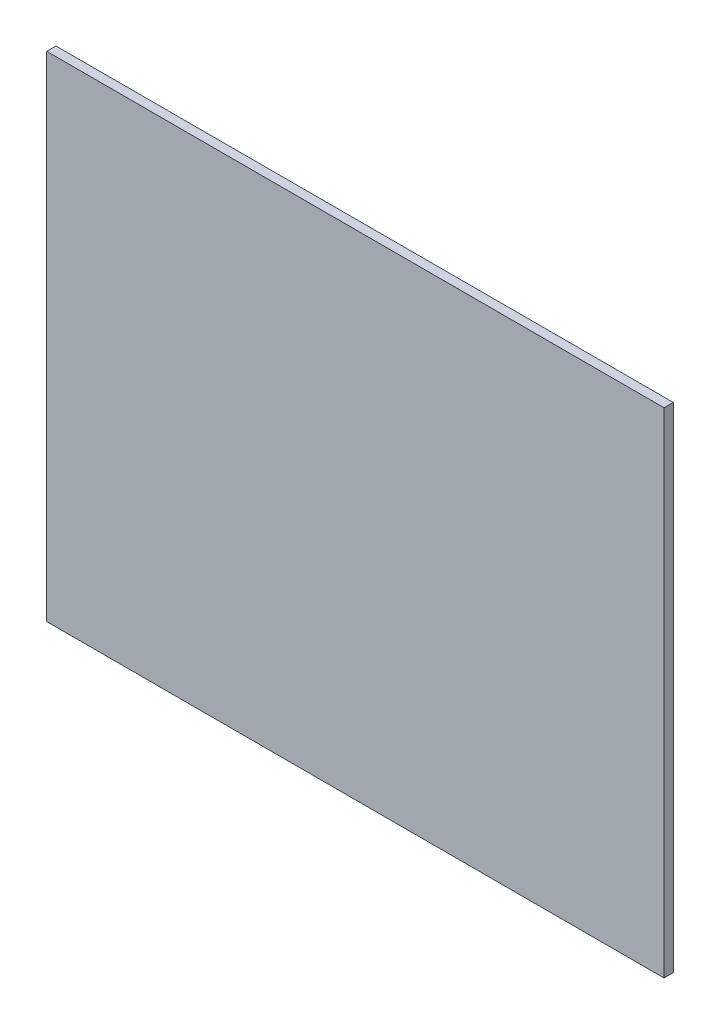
ISO-10303-21;
HEADER;
FILE_DESCRIPTION(('STEP AP214'),'2;1');
FILE_NAME('part.step','',(''),(''),'','','');
FILE_SCHEMA(('AUTOMOTIVE_DESIGN { 1 0 10303 214 1 1 1 1 }'));
ENDSEC;
DATA;
#1=APPLICATION_CONTEXT('core data for automotive mechanical design processes');
#2=APPLICATION_PROTOCOL_DEFINITION('international standard','automotive_design',2000,#1);
#3=PRODUCT_CONTEXT('',#1,'mechanical');
#4=PRODUCT('Part','Part','',(#3));
#5=PRODUCT_RELATED_PRODUCT_CATEGORY('part','',(#4));
#6=PRODUCT_DEFINITION_FORMATION('','',#4);
#7=PRODUCT_DEFINITION_CONTEXT('part definition',#1,'design');
#8=PRODUCT_DEFINITION('design','',#6,#7);
#9=PRODUCT_DEFINITION_SHAPE('','',#8);
#10=(LENGTH_UNIT() NAMED_UNIT(*) SI_UNIT(.MILLI.,.METRE.));
#11=(NAMED_UNIT(*) PLANE_ANGLE_UNIT() SI_UNIT($,.RADIAN.));
#12=(NAMED_UNIT(*) SI_UNIT($,.STERADIAN.) SOLID_ANGLE_UNIT());
#13=UNCERTAINTY_MEASURE_WITH_UNIT(LENGTH_MEASURE(1.E-05),#10,'distance_accuracy_value','');
#14=(GEOMETRIC_REPRESENTATION_CONTEXT(3) GLOBAL_UNCERTAINTY_ASSIGNED_CONTEXT((#13)) GLOBAL_UNIT_ASSIGNED_CONTEXT((#10,
#11,#12)) REPRESENTATION_CONTEXT('',''));
#15=CARTESIAN_POINT('',(0.,0.,0.));
#16=DIRECTION('',(0.,0.,1.));
#17=DIRECTION('',(1.,0.,0.));
#18=AXIS2_PLACEMENT_3D('',#15,#16,#17);
#19=CARTESIAN_POINT('',(100.,80.,3.));
#20=DIRECTION('',(-1.,0.,0.));
#21=DIRECTION('',(0.,-1.,0.));
#22=AXIS2_PLACEMENT_3D('',#19,#20,#21);
#23=PLANE('',#22);
#24=DIRECTION('',(0.,1.,0.));
#25=VECTOR('',#24,1.);
#26=CARTESIAN_POINT('',(100.,80.,0.));
#27=LINE('',#26,#25);
#28=CARTESIAN_POINT('',(100.,-80.,0.));
#29=VERTEX_POINT('',#28);
#30=CARTESIAN_POINT('',(100.,80.,0.));
#31=VERTEX_POINT('',#30);
#32=EDGE_CURVE('E107',#29,#31,#27,.T.);
#33=ORIENTED_EDGE('',*,*,#32,.T.);
#34=DIRECTION('',(0.,0.,-1.));
#35=VECTOR('',#34,1.);
#36=CARTESIAN_POINT('',(100.,80.,3.));
#37=LINE('',#36,#35);
#38=CARTESIAN_POINT('',(100.,80.,3.));
#39=VERTEX_POINT('',#38);
#40=EDGE_CURVE('E11',#39,#31,#37,.T.);
#41=ORIENTED_EDGE('',*,*,#40,.F.);
#42=DIRECTION('',(0.,1.,0.));
#43=VECTOR('',#42,1.);
#44=CARTESIAN_POINT('',(100.,80.,3.));
#45=LINE('',#44,#43);
#46=CARTESIAN_POINT('',(100.,-80.,3.));
#47=VERTEX_POINT('',#46);
#48=EDGE_CURVE('E91',#47,#39,#45,.T.);
#49=ORIENTED_EDGE('',*,*,#48,.F.);
#50=DIRECTION('',(0.,0.,-1.));
#51=VECTOR('',#50,1.);
#52=CARTESIAN_POINT('',(100.,-80.,3.));
#53=LINE('',#52,#51);
#54=EDGE_CURVE('E103',#47,#29,#53,.T.);
#55=ORIENTED_EDGE('',*,*,#54,.T.);
#56=EDGE_LOOP('',(#33,#41,#49,#55));
#57=FACE_BOUND('',#56,.T.);
#58=ADVANCED_FACE('F39',(#57),#23,.F.);
#59=CARTESIAN_POINT('',(-100.,80.,3.));
#60=DIRECTION('',(0.,-1.,0.));
#61=DIRECTION('',(0.,0.,-1.));
#62=AXIS2_PLACEMENT_3D('',#59,#60,#61);
#63=PLANE('',#62);
#64=DIRECTION('',(-1.,0.,0.));
#65=VECTOR('',#64,1.);
#66=CARTESIAN_POINT('',(-100.,80.,0.));
#67=LINE('',#66,#65);
#68=CARTESIAN_POINT('',(-100.,80.,0.));
#69=VERTEX_POINT('',#68);
#70=EDGE_CURVE('E96',#31,#69,#67,.T.);
#71=ORIENTED_EDGE('',*,*,#70,.T.);
#72=DIRECTION('',(0.,0.,-1.));
#73=VECTOR('',#72,1.);
#74=CARTESIAN_POINT('',(-100.,80.,3.));
#75=LINE('',#74,#73);
#76=CARTESIAN_POINT('',(-100.,80.,3.));
#77=VERTEX_POINT('',#76);
#78=EDGE_CURVE('E48',#77,#69,#75,.T.);
#79=ORIENTED_EDGE('',*,*,#78,.F.);
#80=DIRECTION('',(-1.,0.,0.));
#81=VECTOR('',#80,1.);
#82=CARTESIAN_POINT('',(-100.,80.,3.));
#83=LINE('',#82,#81);
#84=EDGE_CURVE('E86',#39,#77,#83,.T.);
#85=ORIENTED_EDGE('',*,*,#84,.F.);
#86=ORIENTED_EDGE('',*,*,#40,.T.);
#87=EDGE_LOOP('',(#71,#79,#85,#86));
#88=FACE_BOUND('',#87,.T.);
#89=ADVANCED_FACE('F95',(#88),#63,.F.);
#90=CARTESIAN_POINT('',(-100.,80.,3.));
#91=DIRECTION('',(1.,0.,0.));
#92=DIRECTION('',(0.,1.,0.));
#93=AXIS2_PLACEMENT_3D('',#90,#91,#92);
#94=PLANE('',#93);
#95=DIRECTION('',(0.,-1.,0.));
#96=VECTOR('',#95,1.);
#97=CARTESIAN_POINT('',(-100.,80.,0.));
#98=LINE('',#97,#96);
#99=CARTESIAN_POINT('',(-100.,-80.,0.));
#100=VERTEX_POINT('',#99);
#101=EDGE_CURVE('E73',#69,#100,#98,.T.);
#102=ORIENTED_EDGE('',*,*,#101,.T.);
#103=DIRECTION('',(0.,0.,-1.));
#104=VECTOR('',#103,1.);
#105=CARTESIAN_POINT('',(-100.,-80.,3.));
#106=LINE('',#105,#104);
#107=CARTESIAN_POINT('',(-100.,-80.,3.));
#108=VERTEX_POINT('',#107);
#109=EDGE_CURVE('E98',#108,#100,#106,.T.);
#110=ORIENTED_EDGE('',*,*,#109,.F.);
#111=DIRECTION('',(0.,-1.,0.));
#112=VECTOR('',#111,1.);
#113=CARTESIAN_POINT('',(-100.,80.,3.));
#114=LINE('',#113,#112);
#115=EDGE_CURVE('E89',#77,#108,#114,.T.);
#116=ORIENTED_EDGE('',*,*,#115,.F.);
#117=ORIENTED_EDGE('',*,*,#78,.T.);
#118=EDGE_LOOP('',(#102,#110,#116,#117));
#119=FACE_BOUND('',#118,.T.);
#120=ADVANCED_FACE('F99',(#119),#94,.F.);
#121=CARTESIAN_POINT('',(-100.,-80.,3.));
#122=DIRECTION('',(0.,1.,0.));
#123=DIRECTION('',(0.,0.,1.));
#124=AXIS2_PLACEMENT_3D('',#121,#122,#123);
#125=PLANE('',#124);
#126=DIRECTION('',(1.,0.,0.));
#127=VECTOR('',#126,1.);
#128=CARTESIAN_POINT('',(-100.,-80.,0.));
#129=LINE('',#128,#127);
#130=EDGE_CURVE('E79',#100,#29,#129,.T.);
#131=ORIENTED_EDGE('',*,*,#130,.T.);
#132=ORIENTED_EDGE('',*,*,#54,.F.);
#133=DIRECTION('',(1.,0.,0.));
#134=VECTOR('',#133,1.);
#135=CARTESIAN_POINT('',(-100.,-80.,3.));
#136=LINE('',#135,#134);
#137=EDGE_CURVE('E56',#108,#47,#136,.T.);
#138=ORIENTED_EDGE('',*,*,#137,.F.);
#139=ORIENTED_EDGE('',*,*,#109,.T.);
#140=EDGE_LOOP('',(#131,#132,#138,#139));
#141=FACE_BOUND('',#140,.T.);
#142=ADVANCED_FACE('F120',(#141),#125,.F.);
#143=CARTESIAN_POINT('',(0.,0.,3.));
#144=DIRECTION('',(0.,0.,1.));
#145=DIRECTION('',(1.,0.,0.));
#146=AXIS2_PLACEMENT_3D('',#143,#144,#145);
#147=PLANE('',#146);
#148=ORIENTED_EDGE('',*,*,#48,.T.);
#149=ORIENTED_EDGE('',*,*,#84,.T.);
#150=ORIENTED_EDGE('',*,*,#115,.T.);
#151=ORIENTED_EDGE('',*,*,#137,.T.);
#152=EDGE_LOOP('',(#148,#149,#150,#151));
#153=FACE_BOUND('',#152,.T.);
#154=ADVANCED_FACE('F87',(#153),#147,.T.);
#155=CARTESIAN_POINT('',(0.,0.,0.));
#156=DIRECTION('',(0.,0.,1.));
#157=DIRECTION('',(1.,0.,0.));
#158=AXIS2_PLACEMENT_3D('',#155,#156,#157);
#159=PLANE('',#158);
#160=ORIENTED_EDGE('',*,*,#32,.F.);
#161=ORIENTED_EDGE('',*,*,#130,.F.);
#162=ORIENTED_EDGE('',*,*,#101,.F.);
#163=ORIENTED_EDGE('',*,*,#70,.F.);
#164=EDGE_LOOP('',(#160,#161,#162,#163));
#165=FACE_BOUND('',#164,.T.);
#166=ADVANCED_FACE('F123',(#165),#159,.F.);
#167=CLOSED_SHELL('',(#58,#89,#120,#142,#154,#166));
#168=MANIFOLD_SOLID_BREP('B2',#167);
#169=ADVANCED_BREP_SHAPE_REPRESENTATION('',(#18,#168),#14);
#170=SHAPE_DEFINITION_REPRESENTATION(#9,#169);
ENDSEC;
END-ISO-10303-21;
